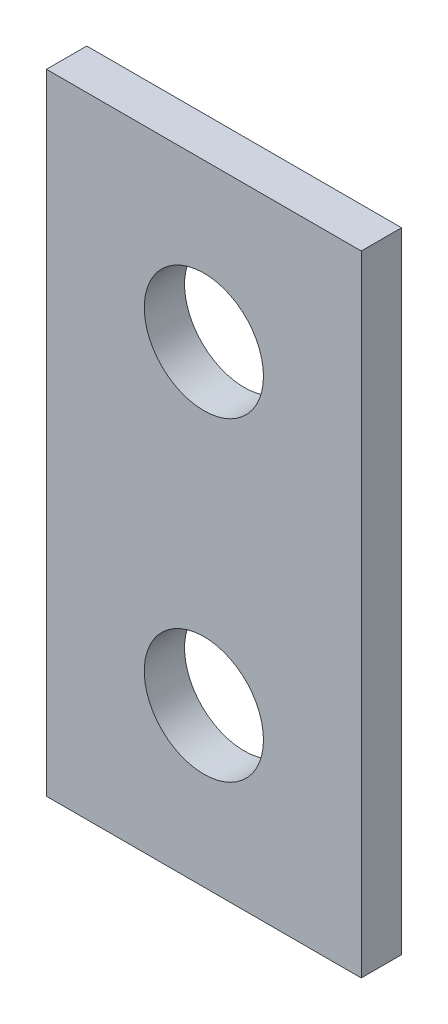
from build123d import *

# Parameters (mm, degrees)
SKETCH1_W           = 9.525
SKETCH1_H           = 19.05
BOSS_EXTRUDE1_DEPTH = 1.2192
SKETCH2_R           = 1.8034
CUT_EXTRUDE1_DEPTH  = 11.718837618


with BuildPart() as part:
    # Sketch1 → Boss-Extrude1 (new body)
    with BuildSketch(Plane.XY):
        Rectangle(SKETCH1_W, SKETCH1_H)
    extrude(amount=-BOSS_EXTRUDE1_DEPTH)

    # Sketch2 → Cut-Extrude1 (cut, through all)
    with BuildSketch(Plane.XY):
        with Locations((0, 4.7625)):
            Circle(SKETCH2_R)
        with Locations((0, -4.7625)):
            Circle(SKETCH2_R)
    extrude(amount=-CUT_EXTRUDE1_DEPTH, mode=Mode.SUBTRACT)


solid = part.part
